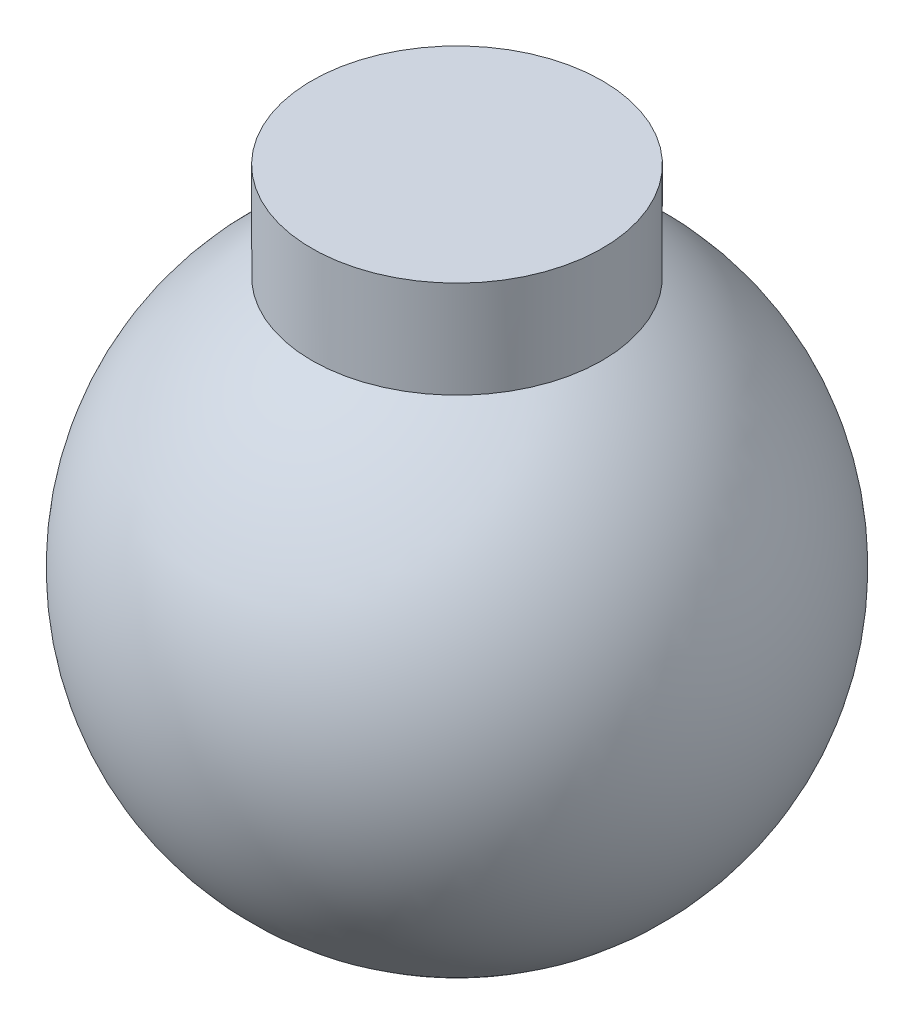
ISO-10303-21;
HEADER;
FILE_DESCRIPTION(('STEP AP214'),'2;1');
FILE_NAME('part.step','',(''),(''),'','','');
FILE_SCHEMA(('AUTOMOTIVE_DESIGN { 1 0 10303 214 1 1 1 1 }'));
ENDSEC;
DATA;
#1=APPLICATION_CONTEXT('core data for automotive mechanical design processes');
#2=APPLICATION_PROTOCOL_DEFINITION('international standard','automotive_design',2000,#1);
#3=PRODUCT_CONTEXT('',#1,'mechanical');
#4=PRODUCT('Part','Part','',(#3));
#5=PRODUCT_RELATED_PRODUCT_CATEGORY('part','',(#4));
#6=PRODUCT_DEFINITION_FORMATION('','',#4);
#7=PRODUCT_DEFINITION_CONTEXT('part definition',#1,'design');
#8=PRODUCT_DEFINITION('design','',#6,#7);
#9=PRODUCT_DEFINITION_SHAPE('','',#8);
#10=(LENGTH_UNIT() NAMED_UNIT(*) SI_UNIT(.MILLI.,.METRE.));
#11=(NAMED_UNIT(*) PLANE_ANGLE_UNIT() SI_UNIT($,.RADIAN.));
#12=(NAMED_UNIT(*) SI_UNIT($,.STERADIAN.) SOLID_ANGLE_UNIT());
#13=UNCERTAINTY_MEASURE_WITH_UNIT(LENGTH_MEASURE(1.E-05),#10,'distance_accuracy_value','');
#14=(GEOMETRIC_REPRESENTATION_CONTEXT(3) GLOBAL_UNCERTAINTY_ASSIGNED_CONTEXT((#13)) GLOBAL_UNIT_ASSIGNED_CONTEXT((#10,
#11,#12)) REPRESENTATION_CONTEXT('',''));
#15=CARTESIAN_POINT('',(0.,0.,0.));
#16=DIRECTION('',(0.,0.,1.));
#17=DIRECTION('',(1.,0.,0.));
#18=AXIS2_PLACEMENT_3D('',#15,#16,#17);
#19=CARTESIAN_POINT('',(0.,0.,0.));
#20=DIRECTION('',(0.,-1.,0.));
#21=DIRECTION('',(-1.,0.,0.));
#22=AXIS2_PLACEMENT_3D('',#19,#20,#21);
#23=SPHERICAL_SURFACE('',#22,5.);
#24=CARTESIAN_POINT('',(0.,4.33012701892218,0.));
#25=DIRECTION('',(0.,-1.,0.));
#26=DIRECTION('',(0.,0.,-1.));
#27=AXIS2_PLACEMENT_3D('',#24,#25,#26);
#28=CIRCLE('',#27,2.50000000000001);
#29=CARTESIAN_POINT('',(0.,4.33012701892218,-2.50000000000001));
#30=VERTEX_POINT('',#29);
#31=EDGE_CURVE('E10',#30,#30,#28,.T.);
#32=ORIENTED_EDGE('',*,*,#31,.T.);
#33=EDGE_LOOP('',(#32));
#34=FACE_BOUND('',#33,.T.);
#35=ADVANCED_FACE('F30',(#34),#23,.T.);
#36=CARTESIAN_POINT('',(0.,0.,0.));
#37=DIRECTION('',(0.,-1.,0.));
#38=DIRECTION('',(0.,0.,-1.));
#39=AXIS2_PLACEMENT_3D('',#36,#37,#38);
#40=CYLINDRICAL_SURFACE('',#39,2.50000000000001);
#41=CARTESIAN_POINT('',(0.,6.,0.));
#42=DIRECTION('',(0.,-1.,0.));
#43=DIRECTION('',(0.,0.,-1.));
#44=AXIS2_PLACEMENT_3D('',#41,#42,#43);
#45=CIRCLE('',#44,2.50000000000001);
#46=CARTESIAN_POINT('',(0.,6.,-2.50000000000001));
#47=VERTEX_POINT('',#46);
#48=EDGE_CURVE('E36',#47,#47,#45,.T.);
#49=ORIENTED_EDGE('',*,*,#48,.T.);
#50=EDGE_LOOP('',(#49));
#51=FACE_BOUND('',#50,.T.);
#52=ORIENTED_EDGE('',*,*,#31,.F.);
#53=EDGE_LOOP('',(#52));
#54=FACE_BOUND('',#53,.T.);
#55=ADVANCED_FACE('F42',(#51,#54),#40,.T.);
#56=CARTESIAN_POINT('',(0.,6.,0.));
#57=DIRECTION('',(0.,1.,0.));
#58=DIRECTION('',(0.,0.,1.));
#59=AXIS2_PLACEMENT_3D('',#56,#57,#58);
#60=PLANE('',#59);
#61=ORIENTED_EDGE('',*,*,#48,.F.);
#62=EDGE_LOOP('',(#61));
#63=FACE_BOUND('',#62,.T.);
#64=ADVANCED_FACE('F45',(#63),#60,.T.);
#65=CLOSED_SHELL('',(#35,#55,#64));
#66=MANIFOLD_SOLID_BREP('B2',#65);
#67=ADVANCED_BREP_SHAPE_REPRESENTATION('',(#18,#66),#14);
#68=SHAPE_DEFINITION_REPRESENTATION(#9,#67);
ENDSEC;
END-ISO-10303-21;
